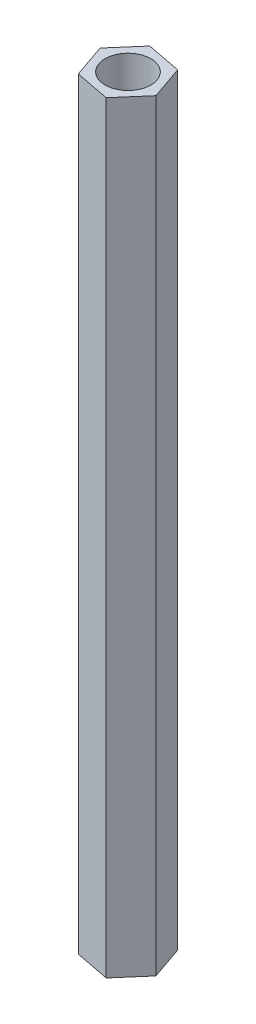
ISO-10303-21;
HEADER;
FILE_DESCRIPTION(('STEP AP214'),'2;1');
FILE_NAME('part.step','',(''),(''),'','','');
FILE_SCHEMA(('AUTOMOTIVE_DESIGN { 1 0 10303 214 1 1 1 1 }'));
ENDSEC;
DATA;
#1=APPLICATION_CONTEXT('core data for automotive mechanical design processes');
#2=APPLICATION_PROTOCOL_DEFINITION('international standard','automotive_design',2000,#1);
#3=PRODUCT_CONTEXT('',#1,'mechanical');
#4=PRODUCT('Part','Part','',(#3));
#5=PRODUCT_RELATED_PRODUCT_CATEGORY('part','',(#4));
#6=PRODUCT_DEFINITION_FORMATION('','',#4);
#7=PRODUCT_DEFINITION_CONTEXT('part definition',#1,'design');
#8=PRODUCT_DEFINITION('design','',#6,#7);
#9=PRODUCT_DEFINITION_SHAPE('','',#8);
#10=(LENGTH_UNIT() NAMED_UNIT(*) SI_UNIT(.MILLI.,.METRE.));
#11=(NAMED_UNIT(*) PLANE_ANGLE_UNIT() SI_UNIT($,.RADIAN.));
#12=(NAMED_UNIT(*) SI_UNIT($,.STERADIAN.) SOLID_ANGLE_UNIT());
#13=UNCERTAINTY_MEASURE_WITH_UNIT(LENGTH_MEASURE(1.E-05),#10,'distance_accuracy_value','');
#14=(GEOMETRIC_REPRESENTATION_CONTEXT(3) GLOBAL_UNCERTAINTY_ASSIGNED_CONTEXT((#13)) GLOBAL_UNIT_ASSIGNED_CONTEXT((#10,
#11,#12)) REPRESENTATION_CONTEXT('',''));
#15=CARTESIAN_POINT('',(0.,0.,0.));
#16=DIRECTION('',(0.,0.,1.));
#17=DIRECTION('',(1.,0.,0.));
#18=AXIS2_PLACEMENT_3D('',#15,#16,#17);
#19=CARTESIAN_POINT('',(0.,50.,0.));
#20=DIRECTION('',(0.,1.,0.));
#21=DIRECTION('',(0.,0.,1.));
#22=AXIS2_PLACEMENT_3D('',#19,#20,#21);
#23=PLANE('',#22);
#24=DIRECTION('',(0.981902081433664,0.,0.189389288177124));
#25=VECTOR('',#24,1.);
#26=CARTESIAN_POINT('',(-1.51258143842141,50.,1.74511624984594));
#27=LINE('',#26,#25);
#28=CARTESIAN_POINT('',(-1.51258143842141,50.,1.74511624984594));
#29=VERTEX_POINT('',#28);
#30=CARTESIAN_POINT('',(0.755024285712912,50.,2.18249207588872));
#31=VERTEX_POINT('',#30);
#32=EDGE_CURVE('E129',#29,#31,#27,.T.);
#33=ORIENTED_EDGE('',*,*,#32,.T.);
#34=DIRECTION('',(0.654966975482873,0.,-0.755657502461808));
#35=VECTOR('',#34,1.);
#36=CARTESIAN_POINT('',(0.755024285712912,50.,2.18249207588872));
#37=LINE('',#36,#35);
#38=CARTESIAN_POINT('',(2.26760572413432,50.,0.437375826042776));
#39=VERTEX_POINT('',#38);
#40=EDGE_CURVE('E87',#31,#39,#37,.T.);
#41=ORIENTED_EDGE('',*,*,#40,.T.);
#42=DIRECTION('',(-0.326935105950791,0.,-0.945046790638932));
#43=VECTOR('',#42,1.);
#44=CARTESIAN_POINT('',(2.26760572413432,50.,0.437375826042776));
#45=LINE('',#44,#43);
#46=CARTESIAN_POINT('',(1.51258143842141,50.,-1.74511624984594));
#47=VERTEX_POINT('',#46);
#48=EDGE_CURVE('E100',#39,#47,#45,.T.);
#49=ORIENTED_EDGE('',*,*,#48,.T.);
#50=DIRECTION('',(-0.981902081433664,0.,-0.189389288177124));
#51=VECTOR('',#50,1.);
#52=CARTESIAN_POINT('',(1.51258143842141,50.,-1.74511624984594));
#53=LINE('',#52,#51);
#54=CARTESIAN_POINT('',(-0.755024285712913,50.,-2.18249207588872));
#55=VERTEX_POINT('',#54);
#56=EDGE_CURVE('E94',#47,#55,#53,.T.);
#57=ORIENTED_EDGE('',*,*,#56,.T.);
#58=DIRECTION('',(-0.654966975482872,0.,0.755657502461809));
#59=VECTOR('',#58,1.);
#60=CARTESIAN_POINT('',(-0.755024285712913,50.,-2.18249207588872));
#61=LINE('',#60,#59);
#62=CARTESIAN_POINT('',(-2.26760572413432,50.,-0.437375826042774));
#63=VERTEX_POINT('',#62);
#64=EDGE_CURVE('E98',#55,#63,#61,.T.);
#65=ORIENTED_EDGE('',*,*,#64,.T.);
#66=DIRECTION('',(0.326935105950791,0.,0.945046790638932));
#67=VECTOR('',#66,1.);
#68=CARTESIAN_POINT('',(-2.26760572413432,50.,-0.437375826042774));
#69=LINE('',#68,#67);
#70=EDGE_CURVE('E50',#63,#29,#69,.T.);
#71=ORIENTED_EDGE('',*,*,#70,.T.);
#72=EDGE_LOOP('',(#33,#41,#49,#57,#65,#71));
#73=FACE_BOUND('',#72,.T.);
#74=CARTESIAN_POINT('',(0.,50.,0.));
#75=DIRECTION('',(0.,1.,0.));
#76=DIRECTION('',(0.,0.,1.));
#77=AXIS2_PLACEMENT_3D('',#74,#75,#76);
#78=CIRCLE('',#77,1.5);
#79=CARTESIAN_POINT('',(0.,50.,1.5));
#80=VERTEX_POINT('',#79);
#81=EDGE_CURVE('E122',#80,#80,#78,.T.);
#82=ORIENTED_EDGE('',*,*,#81,.F.);
#83=EDGE_LOOP('',(#82));
#84=FACE_BOUND('',#83,.T.);
#85=ADVANCED_FACE('F33',(#73,#84),#23,.T.);
#86=CARTESIAN_POINT('',(0.,0.,0.));
#87=DIRECTION('',(0.,1.,0.));
#88=DIRECTION('',(0.,0.,1.));
#89=AXIS2_PLACEMENT_3D('',#86,#87,#88);
#90=PLANE('',#89);
#91=DIRECTION('',(0.981902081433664,0.,0.189389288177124));
#92=VECTOR('',#91,1.);
#93=CARTESIAN_POINT('',(-1.51258143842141,0.,1.74511624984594));
#94=LINE('',#93,#92);
#95=CARTESIAN_POINT('',(-1.51258143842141,0.,1.74511624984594));
#96=VERTEX_POINT('',#95);
#97=CARTESIAN_POINT('',(0.755024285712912,0.,2.18249207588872));
#98=VERTEX_POINT('',#97);
#99=EDGE_CURVE('E118',#96,#98,#94,.T.);
#100=ORIENTED_EDGE('',*,*,#99,.F.);
#101=DIRECTION('',(0.326935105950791,0.,0.945046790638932));
#102=VECTOR('',#101,1.);
#103=CARTESIAN_POINT('',(-2.26760572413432,0.,-0.437375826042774));
#104=LINE('',#103,#102);
#105=CARTESIAN_POINT('',(-2.26760572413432,0.,-0.437375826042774));
#106=VERTEX_POINT('',#105);
#107=EDGE_CURVE('E79',#106,#96,#104,.T.);
#108=ORIENTED_EDGE('',*,*,#107,.F.);
#109=DIRECTION('',(-0.654966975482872,0.,0.755657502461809));
#110=VECTOR('',#109,1.);
#111=CARTESIAN_POINT('',(-0.755024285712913,0.,-2.18249207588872));
#112=LINE('',#111,#110);
#113=CARTESIAN_POINT('',(-0.755024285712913,0.,-2.18249207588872));
#114=VERTEX_POINT('',#113);
#115=EDGE_CURVE('E73',#114,#106,#112,.T.);
#116=ORIENTED_EDGE('',*,*,#115,.F.);
#117=DIRECTION('',(-0.981902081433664,0.,-0.189389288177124));
#118=VECTOR('',#117,1.);
#119=CARTESIAN_POINT('',(1.51258143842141,0.,-1.74511624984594));
#120=LINE('',#119,#118);
#121=CARTESIAN_POINT('',(1.51258143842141,0.,-1.74511624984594));
#122=VERTEX_POINT('',#121);
#123=EDGE_CURVE('E108',#122,#114,#120,.T.);
#124=ORIENTED_EDGE('',*,*,#123,.F.);
#125=DIRECTION('',(-0.326935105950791,0.,-0.945046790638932));
#126=VECTOR('',#125,1.);
#127=CARTESIAN_POINT('',(2.26760572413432,0.,0.437375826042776));
#128=LINE('',#127,#126);
#129=CARTESIAN_POINT('',(2.26760572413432,0.,0.437375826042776));
#130=VERTEX_POINT('',#129);
#131=EDGE_CURVE('E124',#130,#122,#128,.T.);
#132=ORIENTED_EDGE('',*,*,#131,.F.);
#133=DIRECTION('',(0.654966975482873,0.,-0.755657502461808));
#134=VECTOR('',#133,1.);
#135=CARTESIAN_POINT('',(0.755024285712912,0.,2.18249207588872));
#136=LINE('',#135,#134);
#137=EDGE_CURVE('E121',#98,#130,#136,.T.);
#138=ORIENTED_EDGE('',*,*,#137,.F.);
#139=EDGE_LOOP('',(#100,#108,#116,#124,#132,#138));
#140=FACE_BOUND('',#139,.T.);
#141=CARTESIAN_POINT('',(0.,0.,0.));
#142=DIRECTION('',(0.,1.,0.));
#143=DIRECTION('',(0.,0.,1.));
#144=AXIS2_PLACEMENT_3D('',#141,#142,#143);
#145=CIRCLE('',#144,1.5);
#146=CARTESIAN_POINT('',(0.,0.,1.5));
#147=VERTEX_POINT('',#146);
#148=EDGE_CURVE('E222',#147,#147,#145,.T.);
#149=ORIENTED_EDGE('',*,*,#148,.T.);
#150=EDGE_LOOP('',(#149));
#151=FACE_BOUND('',#150,.T.);
#152=ADVANCED_FACE('F138',(#140,#151),#90,.F.);
#153=CARTESIAN_POINT('',(-1.51258143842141,50.,1.74511624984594));
#154=DIRECTION('',(0.189389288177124,0.,-0.981902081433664));
#155=DIRECTION('',(-0.981902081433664,0.,-0.189389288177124));
#156=AXIS2_PLACEMENT_3D('',#153,#154,#155);
#157=PLANE('',#156);
#158=ORIENTED_EDGE('',*,*,#99,.T.);
#159=DIRECTION('',(0.,-1.,0.));
#160=VECTOR('',#159,1.);
#161=CARTESIAN_POINT('',(0.755024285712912,50.,2.18249207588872));
#162=LINE('',#161,#160);
#163=EDGE_CURVE('E11',#31,#98,#162,.T.);
#164=ORIENTED_EDGE('',*,*,#163,.F.);
#165=ORIENTED_EDGE('',*,*,#32,.F.);
#166=DIRECTION('',(0.,-1.,0.));
#167=VECTOR('',#166,1.);
#168=CARTESIAN_POINT('',(-1.51258143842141,50.,1.74511624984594));
#169=LINE('',#168,#167);
#170=EDGE_CURVE('E114',#29,#96,#169,.T.);
#171=ORIENTED_EDGE('',*,*,#170,.T.);
#172=EDGE_LOOP('',(#158,#164,#165,#171));
#173=FACE_BOUND('',#172,.T.);
#174=ADVANCED_FACE('F35',(#173),#157,.F.);
#175=CARTESIAN_POINT('',(0.755024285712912,50.,2.18249207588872));
#176=DIRECTION('',(-0.755657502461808,0.,-0.654966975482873));
#177=DIRECTION('',(-0.654966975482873,0.,0.755657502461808));
#178=AXIS2_PLACEMENT_3D('',#175,#176,#177);
#179=PLANE('',#178);
#180=ORIENTED_EDGE('',*,*,#137,.T.);
#181=DIRECTION('',(0.,-1.,0.));
#182=VECTOR('',#181,1.);
#183=CARTESIAN_POINT('',(2.26760572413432,50.,0.437375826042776));
#184=LINE('',#183,#182);
#185=EDGE_CURVE('E42',#39,#130,#184,.T.);
#186=ORIENTED_EDGE('',*,*,#185,.F.);
#187=ORIENTED_EDGE('',*,*,#40,.F.);
#188=ORIENTED_EDGE('',*,*,#163,.T.);
#189=EDGE_LOOP('',(#180,#186,#187,#188));
#190=FACE_BOUND('',#189,.T.);
#191=ADVANCED_FACE('F163',(#190),#179,.F.);
#192=CARTESIAN_POINT('',(2.26760572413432,50.,0.437375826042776));
#193=DIRECTION('',(-0.945046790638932,0.,0.326935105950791));
#194=DIRECTION('',(0.326935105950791,0.,0.945046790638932));
#195=AXIS2_PLACEMENT_3D('',#192,#193,#194);
#196=PLANE('',#195);
#197=ORIENTED_EDGE('',*,*,#131,.T.);
#198=DIRECTION('',(0.,-1.,0.));
#199=VECTOR('',#198,1.);
#200=CARTESIAN_POINT('',(1.51258143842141,50.,-1.74511624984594));
#201=LINE('',#200,#199);
#202=EDGE_CURVE('E109',#47,#122,#201,.T.);
#203=ORIENTED_EDGE('',*,*,#202,.F.);
#204=ORIENTED_EDGE('',*,*,#48,.F.);
#205=ORIENTED_EDGE('',*,*,#185,.T.);
#206=EDGE_LOOP('',(#197,#203,#204,#205));
#207=FACE_BOUND('',#206,.T.);
#208=ADVANCED_FACE('F135',(#207),#196,.F.);
#209=CARTESIAN_POINT('',(1.51258143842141,50.,-1.74511624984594));
#210=DIRECTION('',(-0.189389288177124,0.,0.981902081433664));
#211=DIRECTION('',(0.981902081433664,0.,0.189389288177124));
#212=AXIS2_PLACEMENT_3D('',#209,#210,#211);
#213=PLANE('',#212);
#214=ORIENTED_EDGE('',*,*,#123,.T.);
#215=DIRECTION('',(0.,-1.,0.));
#216=VECTOR('',#215,1.);
#217=CARTESIAN_POINT('',(-0.755024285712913,50.,-2.18249207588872));
#218=LINE('',#217,#216);
#219=EDGE_CURVE('E105',#55,#114,#218,.T.);
#220=ORIENTED_EDGE('',*,*,#219,.F.);
#221=ORIENTED_EDGE('',*,*,#56,.F.);
#222=ORIENTED_EDGE('',*,*,#202,.T.);
#223=EDGE_LOOP('',(#214,#220,#221,#222));
#224=FACE_BOUND('',#223,.T.);
#225=ADVANCED_FACE('F106',(#224),#213,.F.);
#226=CARTESIAN_POINT('',(-0.755024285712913,50.,-2.18249207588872));
#227=DIRECTION('',(0.755657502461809,0.,0.654966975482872));
#228=DIRECTION('',(0.654966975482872,0.,-0.755657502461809));
#229=AXIS2_PLACEMENT_3D('',#226,#227,#228);
#230=PLANE('',#229);
#231=ORIENTED_EDGE('',*,*,#115,.T.);
#232=DIRECTION('',(0.,-1.,0.));
#233=VECTOR('',#232,1.);
#234=CARTESIAN_POINT('',(-2.26760572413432,50.,-0.437375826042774));
#235=LINE('',#234,#233);
#236=EDGE_CURVE('E110',#63,#106,#235,.T.);
#237=ORIENTED_EDGE('',*,*,#236,.F.);
#238=ORIENTED_EDGE('',*,*,#64,.F.);
#239=ORIENTED_EDGE('',*,*,#219,.T.);
#240=EDGE_LOOP('',(#231,#237,#238,#239));
#241=FACE_BOUND('',#240,.T.);
#242=ADVANCED_FACE('F112',(#241),#230,.F.);
#243=CARTESIAN_POINT('',(-2.26760572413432,50.,-0.437375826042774));
#244=DIRECTION('',(0.945046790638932,0.,-0.326935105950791));
#245=DIRECTION('',(-0.326935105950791,0.,-0.945046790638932));
#246=AXIS2_PLACEMENT_3D('',#243,#244,#245);
#247=PLANE('',#246);
#248=ORIENTED_EDGE('',*,*,#107,.T.);
#249=ORIENTED_EDGE('',*,*,#170,.F.);
#250=ORIENTED_EDGE('',*,*,#70,.F.);
#251=ORIENTED_EDGE('',*,*,#236,.T.);
#252=EDGE_LOOP('',(#248,#249,#250,#251));
#253=FACE_BOUND('',#252,.T.);
#254=ADVANCED_FACE('F143',(#253),#247,.F.);
#255=CARTESIAN_POINT('',(0.,50.,0.));
#256=DIRECTION('',(0.,-1.,0.));
#257=DIRECTION('',(0.,0.,-1.));
#258=AXIS2_PLACEMENT_3D('',#255,#256,#257);
#259=CYLINDRICAL_SURFACE('',#258,1.5);
#260=ORIENTED_EDGE('',*,*,#81,.T.);
#261=EDGE_LOOP('',(#260));
#262=FACE_BOUND('',#261,.T.);
#263=ORIENTED_EDGE('',*,*,#148,.F.);
#264=EDGE_LOOP('',(#263));
#265=FACE_BOUND('',#264,.T.);
#266=ADVANCED_FACE('F145',(#262,#265),#259,.F.);
#267=CLOSED_SHELL('',(#85,#152,#174,#191,#208,#225,#242,#254,#266));
#268=MANIFOLD_SOLID_BREP('B2',#267);
#269=ADVANCED_BREP_SHAPE_REPRESENTATION('',(#18,#268),#14);
#270=SHAPE_DEFINITION_REPRESENTATION(#9,#269);
ENDSEC;
END-ISO-10303-21;
